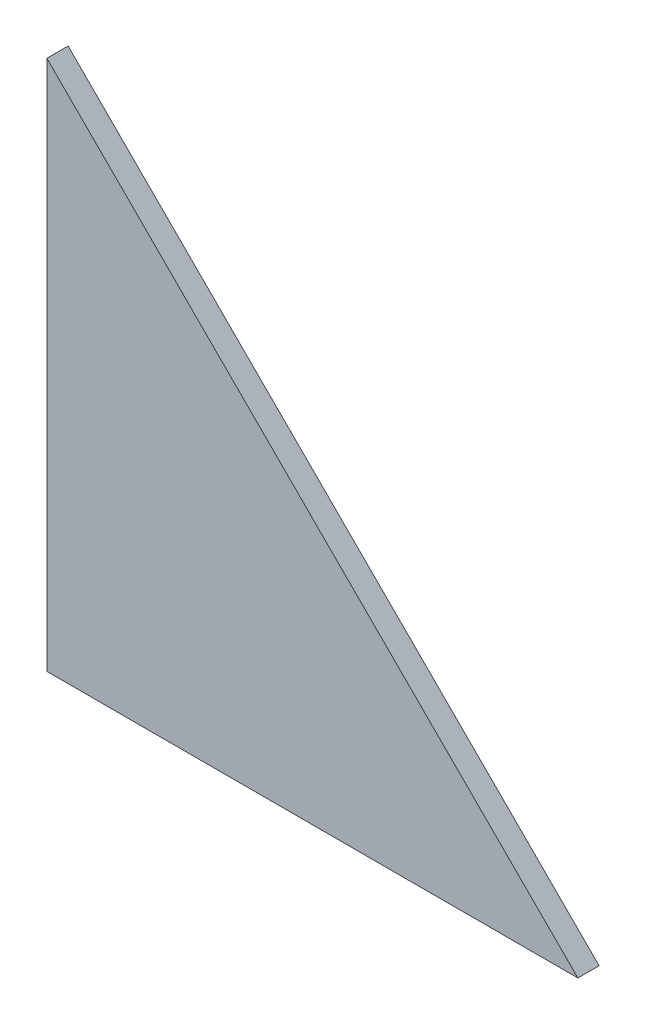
ISO-10303-21;
HEADER;
FILE_DESCRIPTION(('STEP AP214'),'2;1');
FILE_NAME('part.step','',(''),(''),'','','');
FILE_SCHEMA(('AUTOMOTIVE_DESIGN { 1 0 10303 214 1 1 1 1 }'));
ENDSEC;
DATA;
#1=APPLICATION_CONTEXT('core data for automotive mechanical design processes');
#2=APPLICATION_PROTOCOL_DEFINITION('international standard','automotive_design',2000,#1);
#3=PRODUCT_CONTEXT('',#1,'mechanical');
#4=PRODUCT('Part','Part','',(#3));
#5=PRODUCT_RELATED_PRODUCT_CATEGORY('part','',(#4));
#6=PRODUCT_DEFINITION_FORMATION('','',#4);
#7=PRODUCT_DEFINITION_CONTEXT('part definition',#1,'design');
#8=PRODUCT_DEFINITION('design','',#6,#7);
#9=PRODUCT_DEFINITION_SHAPE('','',#8);
#10=(LENGTH_UNIT() NAMED_UNIT(*) SI_UNIT(.MILLI.,.METRE.));
#11=(NAMED_UNIT(*) PLANE_ANGLE_UNIT() SI_UNIT($,.RADIAN.));
#12=(NAMED_UNIT(*) SI_UNIT($,.STERADIAN.) SOLID_ANGLE_UNIT());
#13=UNCERTAINTY_MEASURE_WITH_UNIT(LENGTH_MEASURE(1.E-05),#10,'distance_accuracy_value','');
#14=(GEOMETRIC_REPRESENTATION_CONTEXT(3) GLOBAL_UNCERTAINTY_ASSIGNED_CONTEXT((#13)) GLOBAL_UNIT_ASSIGNED_CONTEXT((#10,
#11,#12)) REPRESENTATION_CONTEXT('',''));
#15=CARTESIAN_POINT('',(0.,0.,0.));
#16=DIRECTION('',(0.,0.,1.));
#17=DIRECTION('',(1.,0.,0.));
#18=AXIS2_PLACEMENT_3D('',#15,#16,#17);
#19=CARTESIAN_POINT('',(53.033008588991,53.033008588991,6.));
#20=DIRECTION('',(0.,0.,1.));
#21=DIRECTION('',(1.,0.,0.));
#22=AXIS2_PLACEMENT_3D('',#19,#20,#21);
#23=PLANE('',#22);
#24=DIRECTION('',(1.,0.,0.));
#25=VECTOR('',#24,1.);
#26=CARTESIAN_POINT('',(0.,0.,6.));
#27=LINE('',#26,#25);
#28=CARTESIAN_POINT('',(0.,0.,6.));
#29=VERTEX_POINT('',#28);
#30=CARTESIAN_POINT('',(150.,0.,6.));
#31=VERTEX_POINT('',#30);
#32=EDGE_CURVE('E72',#29,#31,#27,.T.);
#33=ORIENTED_EDGE('',*,*,#32,.T.);
#34=DIRECTION('',(-0.707106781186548,0.707106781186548,0.));
#35=VECTOR('',#34,1.);
#36=CARTESIAN_POINT('',(150.,0.,6.));
#37=LINE('',#36,#35);
#38=CARTESIAN_POINT('',(0.,150.,6.));
#39=VERTEX_POINT('',#38);
#40=EDGE_CURVE('E65',#31,#39,#37,.T.);
#41=ORIENTED_EDGE('',*,*,#40,.T.);
#42=DIRECTION('',(0.,-1.,0.));
#43=VECTOR('',#42,1.);
#44=CARTESIAN_POINT('',(0.,150.,6.));
#45=LINE('',#44,#43);
#46=EDGE_CURVE('E10',#39,#29,#45,.T.);
#47=ORIENTED_EDGE('',*,*,#46,.T.);
#48=EDGE_LOOP('',(#33,#41,#47));
#49=FACE_BOUND('',#48,.T.);
#50=ADVANCED_FACE('F16',(#49),#23,.T.);
#51=CARTESIAN_POINT('',(53.033008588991,53.033008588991,0.));
#52=DIRECTION('',(0.,0.,1.));
#53=DIRECTION('',(1.,0.,0.));
#54=AXIS2_PLACEMENT_3D('',#51,#52,#53);
#55=PLANE('',#54);
#56=DIRECTION('',(0.,-1.,0.));
#57=VECTOR('',#56,1.);
#58=CARTESIAN_POINT('',(0.,150.,0.));
#59=LINE('',#58,#57);
#60=CARTESIAN_POINT('',(0.,150.,0.));
#61=VERTEX_POINT('',#60);
#62=CARTESIAN_POINT('',(0.,0.,0.));
#63=VERTEX_POINT('',#62);
#64=EDGE_CURVE('E24',#61,#63,#59,.T.);
#65=ORIENTED_EDGE('',*,*,#64,.F.);
#66=DIRECTION('',(-0.707106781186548,0.707106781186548,0.));
#67=VECTOR('',#66,1.);
#68=CARTESIAN_POINT('',(150.,0.,0.));
#69=LINE('',#68,#67);
#70=CARTESIAN_POINT('',(150.,0.,0.));
#71=VERTEX_POINT('',#70);
#72=EDGE_CURVE('E74',#71,#61,#69,.T.);
#73=ORIENTED_EDGE('',*,*,#72,.F.);
#74=DIRECTION('',(1.,0.,0.));
#75=VECTOR('',#74,1.);
#76=CARTESIAN_POINT('',(0.,0.,0.));
#77=LINE('',#76,#75);
#78=EDGE_CURVE('E70',#63,#71,#77,.T.);
#79=ORIENTED_EDGE('',*,*,#78,.F.);
#80=EDGE_LOOP('',(#65,#73,#79));
#81=FACE_BOUND('',#80,.T.);
#82=ADVANCED_FACE('F76',(#81),#55,.F.);
#83=CARTESIAN_POINT('',(0.,150.,0.));
#84=DIRECTION('',(1.,0.,0.));
#85=DIRECTION('',(0.,1.,0.));
#86=AXIS2_PLACEMENT_3D('',#83,#84,#85);
#87=PLANE('',#86);
#88=ORIENTED_EDGE('',*,*,#64,.T.);
#89=DIRECTION('',(0.,0.,1.));
#90=VECTOR('',#89,1.);
#91=CARTESIAN_POINT('',(0.,0.,0.));
#92=LINE('',#91,#90);
#93=EDGE_CURVE('E59',#63,#29,#92,.T.);
#94=ORIENTED_EDGE('',*,*,#93,.T.);
#95=ORIENTED_EDGE('',*,*,#46,.F.);
#96=DIRECTION('',(0.,0.,1.));
#97=VECTOR('',#96,1.);
#98=CARTESIAN_POINT('',(0.,150.,0.));
#99=LINE('',#98,#97);
#100=EDGE_CURVE('E62',#61,#39,#99,.T.);
#101=ORIENTED_EDGE('',*,*,#100,.F.);
#102=EDGE_LOOP('',(#88,#94,#95,#101));
#103=FACE_BOUND('',#102,.T.);
#104=ADVANCED_FACE('F58',(#103),#87,.F.);
#105=CARTESIAN_POINT('',(150.,0.,0.));
#106=DIRECTION('',(-0.707106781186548,-0.707106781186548,0.));
#107=DIRECTION('',(-0.707106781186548,0.707106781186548,0.));
#108=AXIS2_PLACEMENT_3D('',#105,#106,#107);
#109=PLANE('',#108);
#110=ORIENTED_EDGE('',*,*,#72,.T.);
#111=ORIENTED_EDGE('',*,*,#100,.T.);
#112=ORIENTED_EDGE('',*,*,#40,.F.);
#113=DIRECTION('',(0.,0.,1.));
#114=VECTOR('',#113,1.);
#115=CARTESIAN_POINT('',(150.,0.,0.));
#116=LINE('',#115,#114);
#117=EDGE_CURVE('E79',#71,#31,#116,.T.);
#118=ORIENTED_EDGE('',*,*,#117,.F.);
#119=EDGE_LOOP('',(#110,#111,#112,#118));
#120=FACE_BOUND('',#119,.T.);
#121=ADVANCED_FACE('F95',(#120),#109,.F.);
#122=CARTESIAN_POINT('',(0.,0.,0.));
#123=DIRECTION('',(0.,1.,0.));
#124=DIRECTION('',(1.,0.,0.));
#125=AXIS2_PLACEMENT_3D('',#122,#123,#124);
#126=PLANE('',#125);
#127=ORIENTED_EDGE('',*,*,#78,.T.);
#128=ORIENTED_EDGE('',*,*,#117,.T.);
#129=ORIENTED_EDGE('',*,*,#32,.F.);
#130=ORIENTED_EDGE('',*,*,#93,.F.);
#131=EDGE_LOOP('',(#127,#128,#129,#130));
#132=FACE_BOUND('',#131,.T.);
#133=ADVANCED_FACE('F68',(#132),#126,.F.);
#134=CLOSED_SHELL('',(#50,#82,#104,#121,#133));
#135=MANIFOLD_SOLID_BREP('B1',#134);
#136=ADVANCED_BREP_SHAPE_REPRESENTATION('',(#18,#135),#14);
#137=SHAPE_DEFINITION_REPRESENTATION(#9,#136);
ENDSEC;
END-ISO-10303-21;
